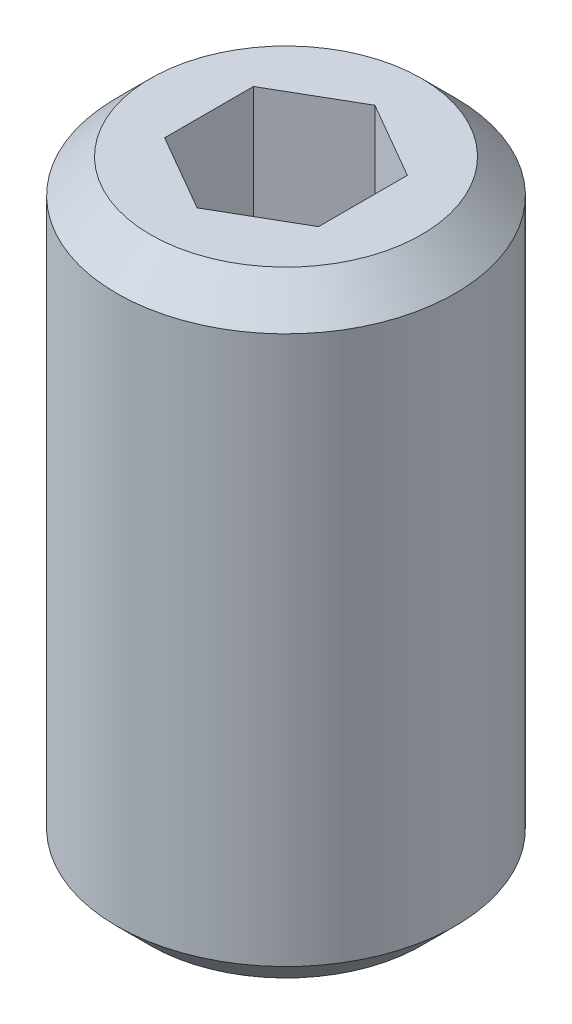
ISO-10303-21;
HEADER;
FILE_DESCRIPTION(('STEP AP214'),'2;1');
FILE_NAME('part.step','',(''),(''),'','','');
FILE_SCHEMA(('AUTOMOTIVE_DESIGN { 1 0 10303 214 1 1 1 1 }'));
ENDSEC;
DATA;
#1=APPLICATION_CONTEXT('core data for automotive mechanical design processes');
#2=APPLICATION_PROTOCOL_DEFINITION('international standard','automotive_design',2000,#1);
#3=PRODUCT_CONTEXT('',#1,'mechanical');
#4=PRODUCT('Part','Part','',(#3));
#5=PRODUCT_RELATED_PRODUCT_CATEGORY('part','',(#4));
#6=PRODUCT_DEFINITION_FORMATION('','',#4);
#7=PRODUCT_DEFINITION_CONTEXT('part definition',#1,'design');
#8=PRODUCT_DEFINITION('design','',#6,#7);
#9=PRODUCT_DEFINITION_SHAPE('','',#8);
#10=(LENGTH_UNIT() NAMED_UNIT(*) SI_UNIT(.MILLI.,.METRE.));
#11=(NAMED_UNIT(*) PLANE_ANGLE_UNIT() SI_UNIT($,.RADIAN.));
#12=(NAMED_UNIT(*) SI_UNIT($,.STERADIAN.) SOLID_ANGLE_UNIT());
#13=UNCERTAINTY_MEASURE_WITH_UNIT(LENGTH_MEASURE(1.E-05),#10,'distance_accuracy_value','');
#14=(GEOMETRIC_REPRESENTATION_CONTEXT(3) GLOBAL_UNCERTAINTY_ASSIGNED_CONTEXT((#13)) GLOBAL_UNIT_ASSIGNED_CONTEXT((#10,
#11,#12)) REPRESENTATION_CONTEXT('',''));
#15=CARTESIAN_POINT('',(0.,0.,0.));
#16=DIRECTION('',(0.,0.,1.));
#17=DIRECTION('',(1.,0.,0.));
#18=AXIS2_PLACEMENT_3D('',#15,#16,#17);
#19=CARTESIAN_POINT('',(0.,-6.,0.));
#20=DIRECTION('',(0.,1.,0.));
#21=DIRECTION('',(0.,0.,1.));
#22=AXIS2_PLACEMENT_3D('',#19,#20,#21);
#23=PLANE('',#22);
#24=CARTESIAN_POINT('',(0.,-6.,0.));
#25=DIRECTION('',(0.,1.,0.));
#26=DIRECTION('',(0.,0.,1.));
#27=AXIS2_PLACEMENT_3D('',#24,#25,#26);
#28=CIRCLE('',#27,1.32);
#29=CARTESIAN_POINT('',(0.,-6.,1.32));
#30=VERTEX_POINT('',#29);
#31=EDGE_CURVE('E473',#30,#30,#28,.F.);
#32=ORIENTED_EDGE('',*,*,#31,.T.);
#33=EDGE_LOOP('',(#32));
#34=FACE_BOUND('',#33,.T.);
#35=ADVANCED_FACE('F362',(#34),#23,.F.);
#36=CARTESIAN_POINT('',(0.,0.,0.));
#37=DIRECTION('',(0.,1.,0.));
#38=DIRECTION('',(0.,0.,1.));
#39=AXIS2_PLACEMENT_3D('',#36,#37,#38);
#40=CYLINDRICAL_SURFACE('',#39,1.65);
#41=CARTESIAN_POINT('',(0.,-0.330000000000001,0.));
#42=DIRECTION('',(0.,-1.,0.));
#43=DIRECTION('',(0.,0.,-1.));
#44=AXIS2_PLACEMENT_3D('',#41,#42,#43);
#45=CIRCLE('',#44,1.65);
#46=CARTESIAN_POINT('',(0.,-0.330000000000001,-1.65));
#47=VERTEX_POINT('',#46);
#48=EDGE_CURVE('E11',#47,#47,#45,.T.);
#49=ORIENTED_EDGE('',*,*,#48,.T.);
#50=EDGE_LOOP('',(#49));
#51=FACE_BOUND('',#50,.T.);
#52=CARTESIAN_POINT('',(0.,-5.67,0.));
#53=DIRECTION('',(0.,1.,0.));
#54=DIRECTION('',(0.,0.,1.));
#55=AXIS2_PLACEMENT_3D('',#52,#53,#54);
#56=CIRCLE('',#55,1.65);
#57=CARTESIAN_POINT('',(0.,-5.67,1.65));
#58=VERTEX_POINT('',#57);
#59=EDGE_CURVE('E464',#58,#58,#56,.T.);
#60=ORIENTED_EDGE('',*,*,#59,.T.);
#61=EDGE_LOOP('',(#60));
#62=FACE_BOUND('',#61,.T.);
#63=ADVANCED_FACE('F496',(#51,#62),#40,.T.);
#64=CARTESIAN_POINT('',(0.,0.,0.));
#65=DIRECTION('',(0.,-1.,0.));
#66=DIRECTION('',(0.,0.,-1.));
#67=AXIS2_PLACEMENT_3D('',#64,#65,#66);
#68=PLANE('',#67);
#69=DIRECTION('',(0.866025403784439,0.,-0.5));
#70=VECTOR('',#69,1.);
#71=CARTESIAN_POINT('',(0.,0.,0.866025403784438));
#72=LINE('',#71,#70);
#73=CARTESIAN_POINT('',(0.,0.,0.866025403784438));
#74=VERTEX_POINT('',#73);
#75=CARTESIAN_POINT('',(0.749999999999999,0.,0.433012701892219));
#76=VERTEX_POINT('',#75);
#77=EDGE_CURVE('E430',#74,#76,#72,.T.);
#78=ORIENTED_EDGE('',*,*,#77,.F.);
#79=DIRECTION('',(0.866025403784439,0.,0.5));
#80=VECTOR('',#79,1.);
#81=CARTESIAN_POINT('',(-0.749999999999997,0.,0.43301270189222));
#82=LINE('',#81,#80);
#83=CARTESIAN_POINT('',(-0.749999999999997,0.,0.43301270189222));
#84=VERTEX_POINT('',#83);
#85=EDGE_CURVE('E376',#84,#74,#82,.T.);
#86=ORIENTED_EDGE('',*,*,#85,.F.);
#87=DIRECTION('',(0.,0.,1.));
#88=VECTOR('',#87,1.);
#89=CARTESIAN_POINT('',(-0.749999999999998,0.,-0.433012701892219));
#90=LINE('',#89,#88);
#91=CARTESIAN_POINT('',(-0.749999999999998,0.,-0.433012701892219));
#92=VERTEX_POINT('',#91);
#93=EDGE_CURVE('E446',#92,#84,#90,.T.);
#94=ORIENTED_EDGE('',*,*,#93,.F.);
#95=DIRECTION('',(-0.866025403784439,0.,0.5));
#96=VECTOR('',#95,1.);
#97=CARTESIAN_POINT('',(0.,0.,-0.866025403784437));
#98=LINE('',#97,#96);
#99=CARTESIAN_POINT('',(0.,0.,-0.866025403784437));
#100=VERTEX_POINT('',#99);
#101=EDGE_CURVE('E440',#100,#92,#98,.T.);
#102=ORIENTED_EDGE('',*,*,#101,.F.);
#103=DIRECTION('',(-0.866025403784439,0.,-0.499999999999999));
#104=VECTOR('',#103,1.);
#105=CARTESIAN_POINT('',(0.749999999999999,0.,-0.433012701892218));
#106=LINE('',#105,#104);
#107=CARTESIAN_POINT('',(0.749999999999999,0.,-0.433012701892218));
#108=VERTEX_POINT('',#107);
#109=EDGE_CURVE('E438',#108,#100,#106,.T.);
#110=ORIENTED_EDGE('',*,*,#109,.F.);
#111=DIRECTION('',(0.,0.,-1.));
#112=VECTOR('',#111,1.);
#113=CARTESIAN_POINT('',(0.749999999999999,0.,0.433012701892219));
#114=LINE('',#113,#112);
#115=EDGE_CURVE('E419',#76,#108,#114,.T.);
#116=ORIENTED_EDGE('',*,*,#115,.F.);
#117=EDGE_LOOP('',(#78,#86,#94,#102,#110,#116));
#118=FACE_BOUND('',#117,.T.);
#119=CARTESIAN_POINT('',(0.,0.,0.));
#120=DIRECTION('',(0.,-1.,0.));
#121=DIRECTION('',(0.,0.,-1.));
#122=AXIS2_PLACEMENT_3D('',#119,#120,#121);
#123=CIRCLE('',#122,1.32);
#124=CARTESIAN_POINT('',(0.,0.,-1.32));
#125=VERTEX_POINT('',#124);
#126=EDGE_CURVE('E369',#125,#125,#123,.F.);
#127=ORIENTED_EDGE('',*,*,#126,.T.);
#128=EDGE_LOOP('',(#127));
#129=FACE_BOUND('',#128,.T.);
#130=ADVANCED_FACE('F434',(#118,#129),#68,.F.);
#131=CARTESIAN_POINT('',(0.,-5.67,0.));
#132=DIRECTION('',(0.,1.,0.));
#133=DIRECTION('',(0.,0.,1.));
#134=AXIS2_PLACEMENT_3D('',#131,#132,#133);
#135=CONICAL_SURFACE('',#134,1.65,0.785398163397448);
#136=ORIENTED_EDGE('',*,*,#31,.F.);
#137=EDGE_LOOP('',(#136));
#138=FACE_BOUND('',#137,.T.);
#139=ORIENTED_EDGE('',*,*,#59,.F.);
#140=EDGE_LOOP('',(#139));
#141=FACE_BOUND('',#140,.T.);
#142=ADVANCED_FACE('F481',(#138,#141),#135,.T.);
#143=CARTESIAN_POINT('',(0.,0.,0.));
#144=DIRECTION('',(0.,-1.,0.));
#145=DIRECTION('',(0.,0.,-1.));
#146=AXIS2_PLACEMENT_3D('',#143,#144,#145);
#147=CONICAL_SURFACE('',#146,1.32,0.785398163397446);
#148=CARTESIAN_POINT('',(0.,-0.330000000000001,-1.65));
#149=CARTESIAN_POINT('',(0.,-0.326562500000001,-1.6465625));
#150=CARTESIAN_POINT('',(0.,-0.323125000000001,-1.643125));
#151=CARTESIAN_POINT('',(0.,-0.316250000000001,-1.63625));
#152=CARTESIAN_POINT('',(0.,-0.312812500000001,-1.6328125));
#153=CARTESIAN_POINT('',(0.,-0.305937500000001,-1.6259375));
#154=CARTESIAN_POINT('',(0.,-0.302500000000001,-1.6225));
#155=CARTESIAN_POINT('',(0.,-0.295625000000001,-1.615625));
#156=CARTESIAN_POINT('',(0.,-0.292187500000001,-1.6121875));
#157=CARTESIAN_POINT('',(0.,-0.285312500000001,-1.6053125));
#158=CARTESIAN_POINT('',(0.,-0.281875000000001,-1.601875));
#159=CARTESIAN_POINT('',(0.,-0.275000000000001,-1.595));
#160=CARTESIAN_POINT('',(0.,-0.271562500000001,-1.5915625));
#161=CARTESIAN_POINT('',(0.,-0.264687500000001,-1.5846875));
#162=CARTESIAN_POINT('',(0.,-0.261250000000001,-1.58125));
#163=CARTESIAN_POINT('',(0.,-0.254375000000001,-1.574375));
#164=CARTESIAN_POINT('',(0.,-0.250937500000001,-1.5709375));
#165=CARTESIAN_POINT('',(0.,-0.244062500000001,-1.5640625));
#166=CARTESIAN_POINT('',(0.,-0.240625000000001,-1.560625));
#167=CARTESIAN_POINT('',(0.,-0.233750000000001,-1.55375));
#168=CARTESIAN_POINT('',(0.,-0.230312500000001,-1.5503125));
#169=CARTESIAN_POINT('',(0.,-0.223437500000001,-1.5434375));
#170=CARTESIAN_POINT('',(0.,-0.220000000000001,-1.54));
#171=CARTESIAN_POINT('',(0.,-0.213125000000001,-1.533125));
#172=CARTESIAN_POINT('',(0.,-0.209687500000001,-1.5296875));
#173=CARTESIAN_POINT('',(0.,-0.202812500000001,-1.5228125));
#174=CARTESIAN_POINT('',(0.,-0.199375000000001,-1.519375));
#175=CARTESIAN_POINT('',(0.,-0.192500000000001,-1.5125));
#176=CARTESIAN_POINT('',(0.,-0.189062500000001,-1.5090625));
#177=CARTESIAN_POINT('',(0.,-0.182187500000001,-1.5021875));
#178=CARTESIAN_POINT('',(0.,-0.178750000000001,-1.49875));
#179=CARTESIAN_POINT('',(0.,-0.171875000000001,-1.491875));
#180=CARTESIAN_POINT('',(0.,-0.168437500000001,-1.4884375));
#181=CARTESIAN_POINT('',(0.,-0.161562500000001,-1.4815625));
#182=CARTESIAN_POINT('',(0.,-0.158125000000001,-1.478125));
#183=CARTESIAN_POINT('',(0.,-0.151250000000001,-1.47125));
#184=CARTESIAN_POINT('',(0.,-0.147812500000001,-1.4678125));
#185=CARTESIAN_POINT('',(0.,-0.140937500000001,-1.4609375));
#186=CARTESIAN_POINT('',(0.,-0.137500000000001,-1.4575));
#187=CARTESIAN_POINT('',(0.,-0.130625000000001,-1.450625));
#188=CARTESIAN_POINT('',(0.,-0.127187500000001,-1.4471875));
#189=CARTESIAN_POINT('',(0.,-0.120312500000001,-1.4403125));
#190=CARTESIAN_POINT('',(0.,-0.116875,-1.436875));
#191=CARTESIAN_POINT('',(0.,-0.11,-1.43));
#192=CARTESIAN_POINT('',(0.,-0.1065625,-1.4265625));
#193=CARTESIAN_POINT('',(0.,-0.0996875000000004,-1.4196875));
#194=CARTESIAN_POINT('',(0.,-0.0962500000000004,-1.41625));
#195=CARTESIAN_POINT('',(0.,-0.0893750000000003,-1.409375));
#196=CARTESIAN_POINT('',(0.,-0.0859375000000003,-1.4059375));
#197=CARTESIAN_POINT('',(0.,-0.0790625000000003,-1.3990625));
#198=CARTESIAN_POINT('',(0.,-0.0756250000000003,-1.395625));
#199=CARTESIAN_POINT('',(0.,-0.0687500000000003,-1.38875));
#200=CARTESIAN_POINT('',(0.,-0.0653125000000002,-1.3853125));
#201=CARTESIAN_POINT('',(0.,-0.0584375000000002,-1.3784375));
#202=CARTESIAN_POINT('',(0.,-0.0550000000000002,-1.375));
#203=CARTESIAN_POINT('',(0.,-0.0481250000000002,-1.368125));
#204=CARTESIAN_POINT('',(0.,-0.0446875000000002,-1.3646875));
#205=CARTESIAN_POINT('',(0.,-0.0378125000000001,-1.3578125));
#206=CARTESIAN_POINT('',(0.,-0.0343750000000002,-1.354375));
#207=CARTESIAN_POINT('',(0.,-0.0275000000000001,-1.3475));
#208=CARTESIAN_POINT('',(0.,-0.0240625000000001,-1.3440625));
#209=CARTESIAN_POINT('',(0.,-0.0171875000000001,-1.3371875));
#210=CARTESIAN_POINT('',(0.,-0.0137500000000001,-1.33375));
#211=CARTESIAN_POINT('',(0.,-0.00687500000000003,-1.326875));
#212=CARTESIAN_POINT('',(0.,-0.00343750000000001,-1.3234375));
#213=CARTESIAN_POINT('',(0.,0.,-1.32));
#214=B_SPLINE_CURVE_WITH_KNOTS('',3,(#148,#149,#150,#151,#152,#153,#154,#155,#156,#157,#158,
#159,#160,#161,#162,#163,#164,#165,#166,#167,#168,#169,#170,#171,#172,#173,#174,#175,#176,#177,
#178,#179,#180,#181,#182,#183,#184,#185,#186,#187,#188,#189,#190,#191,#192,#193,#194,#195,#196,
#197,#198,#199,#200,#201,#202,#203,#204,#205,#206,#207,#208,#209,#210,#211,#212,#213),
.UNSPECIFIED.,.F.,.F.,(4,2,2,2,2,2,2,2,2,2,2,2,2,2,2,2,2,2,2,2,2,2,2,2,2,2,2,2,2,2,2,2,4),(0.,
0.0145840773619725,0.0291681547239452,0.0437522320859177,0.0583363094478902,0.0729203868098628,
0.0875044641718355,0.102088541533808,0.11667261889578,0.131256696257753,0.145840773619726,
0.160424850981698,0.175008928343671,0.189593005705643,0.204177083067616,0.218761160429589,
0.233345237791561,0.247929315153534,0.262513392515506,0.277097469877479,0.291681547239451,
0.306265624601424,0.320849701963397,0.335433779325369,0.350017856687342,0.364601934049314,
0.379186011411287,0.39377008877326,0.408354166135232,0.422938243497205,0.437522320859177,
0.45210639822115,0.466690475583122),.UNSPECIFIED.);
#215=EDGE_CURVE('BSEAM478',#47,#125,#214,.T.);
#216=ORIENTED_EDGE('',*,*,#48,.F.);
#217=ORIENTED_EDGE('',*,*,#126,.F.);
#218=ORIENTED_EDGE('',*,*,#215,.T.);
#219=ORIENTED_EDGE('',*,*,#215,.F.);
#220=EDGE_LOOP('',(#216,#218,#217,#219));
#221=FACE_BOUND('',#220,.T.);
#222=ADVANCED_FACE('F478',(#221),#147,.T.);
#223=CARTESIAN_POINT('',(-0.749999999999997,-2.5,0.43301270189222));
#224=DIRECTION('',(-0.5,0.,0.866025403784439));
#225=DIRECTION('',(0.866025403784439,0.,0.5));
#226=AXIS2_PLACEMENT_3D('',#223,#224,#225);
#227=PLANE('',#226);
#228=ORIENTED_EDGE('',*,*,#85,.T.);
#229=DIRECTION('',(0.,1.,0.));
#230=VECTOR('',#229,1.);
#231=CARTESIAN_POINT('',(0.,-2.5,0.866025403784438));
#232=LINE('',#231,#230);
#233=CARTESIAN_POINT('',(0.,-2.5,0.866025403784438));
#234=VERTEX_POINT('',#233);
#235=EDGE_CURVE('E427',#234,#74,#232,.T.);
#236=ORIENTED_EDGE('',*,*,#235,.F.);
#237=DIRECTION('',(0.866025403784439,0.,0.5));
#238=VECTOR('',#237,1.);
#239=CARTESIAN_POINT('',(-0.749999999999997,-2.5,0.43301270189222));
#240=LINE('',#239,#238);
#241=CARTESIAN_POINT('',(-0.749999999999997,-2.5,0.43301270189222));
#242=VERTEX_POINT('',#241);
#243=EDGE_CURVE('E448',#242,#234,#240,.T.);
#244=ORIENTED_EDGE('',*,*,#243,.F.);
#245=DIRECTION('',(0.,1.,0.));
#246=VECTOR('',#245,1.);
#247=CARTESIAN_POINT('',(-0.749999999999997,-2.5,0.43301270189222));
#248=LINE('',#247,#246);
#249=EDGE_CURVE('E383',#242,#84,#248,.T.);
#250=ORIENTED_EDGE('',*,*,#249,.T.);
#251=EDGE_LOOP('',(#228,#236,#244,#250));
#252=FACE_BOUND('',#251,.T.);
#253=ADVANCED_FACE('F480',(#252),#227,.F.);
#254=CARTESIAN_POINT('',(-0.749999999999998,-2.5,-0.433012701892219));
#255=DIRECTION('',(-1.,0.,0.));
#256=DIRECTION('',(0.,0.,1.));
#257=AXIS2_PLACEMENT_3D('',#254,#255,#256);
#258=PLANE('',#257);
#259=ORIENTED_EDGE('',*,*,#93,.T.);
#260=ORIENTED_EDGE('',*,*,#249,.F.);
#261=DIRECTION('',(0.,0.,1.));
#262=VECTOR('',#261,1.);
#263=CARTESIAN_POINT('',(-0.749999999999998,-2.5,-0.433012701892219));
#264=LINE('',#263,#262);
#265=CARTESIAN_POINT('',(-0.749999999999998,-2.5,-0.433012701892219));
#266=VERTEX_POINT('',#265);
#267=EDGE_CURVE('E460',#266,#242,#264,.T.);
#268=ORIENTED_EDGE('',*,*,#267,.F.);
#269=DIRECTION('',(0.,1.,0.));
#270=VECTOR('',#269,1.);
#271=CARTESIAN_POINT('',(-0.749999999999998,-2.5,-0.433012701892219));
#272=LINE('',#271,#270);
#273=EDGE_CURVE('E465',#266,#92,#272,.T.);
#274=ORIENTED_EDGE('',*,*,#273,.T.);
#275=EDGE_LOOP('',(#259,#260,#268,#274));
#276=FACE_BOUND('',#275,.T.);
#277=ADVANCED_FACE('F489',(#276),#258,.F.);
#278=CARTESIAN_POINT('',(0.,-2.5,-0.866025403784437));
#279=DIRECTION('',(-0.5,0.,-0.866025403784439));
#280=DIRECTION('',(-0.866025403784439,0.,0.5));
#281=AXIS2_PLACEMENT_3D('',#278,#279,#280);
#282=PLANE('',#281);
#283=ORIENTED_EDGE('',*,*,#101,.T.);
#284=ORIENTED_EDGE('',*,*,#273,.F.);
#285=DIRECTION('',(-0.866025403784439,0.,0.5));
#286=VECTOR('',#285,1.);
#287=CARTESIAN_POINT('',(0.,-2.5,-0.866025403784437));
#288=LINE('',#287,#286);
#289=CARTESIAN_POINT('',(0.,-2.5,-0.866025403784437));
#290=VERTEX_POINT('',#289);
#291=EDGE_CURVE('E457',#290,#266,#288,.T.);
#292=ORIENTED_EDGE('',*,*,#291,.F.);
#293=DIRECTION('',(0.,1.,0.));
#294=VECTOR('',#293,1.);
#295=CARTESIAN_POINT('',(0.,-2.5,-0.866025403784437));
#296=LINE('',#295,#294);
#297=EDGE_CURVE('E467',#290,#100,#296,.T.);
#298=ORIENTED_EDGE('',*,*,#297,.T.);
#299=EDGE_LOOP('',(#283,#284,#292,#298));
#300=FACE_BOUND('',#299,.T.);
#301=ADVANCED_FACE('F521',(#300),#282,.F.);
#302=CARTESIAN_POINT('',(0.749999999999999,-2.5,-0.433012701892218));
#303=DIRECTION('',(0.499999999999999,0.,-0.866025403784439));
#304=DIRECTION('',(-0.866025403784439,0.,-0.499999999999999));
#305=AXIS2_PLACEMENT_3D('',#302,#303,#304);
#306=PLANE('',#305);
#307=ORIENTED_EDGE('',*,*,#109,.T.);
#308=ORIENTED_EDGE('',*,*,#297,.F.);
#309=DIRECTION('',(-0.866025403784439,0.,-0.499999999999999));
#310=VECTOR('',#309,1.);
#311=CARTESIAN_POINT('',(0.749999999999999,-2.5,-0.433012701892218));
#312=LINE('',#311,#310);
#313=CARTESIAN_POINT('',(0.749999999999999,-2.5,-0.433012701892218));
#314=VERTEX_POINT('',#313);
#315=EDGE_CURVE('E454',#314,#290,#312,.T.);
#316=ORIENTED_EDGE('',*,*,#315,.F.);
#317=DIRECTION('',(0.,1.,0.));
#318=VECTOR('',#317,1.);
#319=CARTESIAN_POINT('',(0.749999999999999,-2.5,-0.433012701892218));
#320=LINE('',#319,#318);
#321=EDGE_CURVE('E426',#314,#108,#320,.T.);
#322=ORIENTED_EDGE('',*,*,#321,.T.);
#323=EDGE_LOOP('',(#307,#308,#316,#322));
#324=FACE_BOUND('',#323,.T.);
#325=ADVANCED_FACE('F528',(#324),#306,.F.);
#326=CARTESIAN_POINT('',(0.749999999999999,-2.5,0.433012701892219));
#327=DIRECTION('',(1.,0.,0.));
#328=DIRECTION('',(0.,0.,-1.));
#329=AXIS2_PLACEMENT_3D('',#326,#327,#328);
#330=PLANE('',#329);
#331=ORIENTED_EDGE('',*,*,#115,.T.);
#332=ORIENTED_EDGE('',*,*,#321,.F.);
#333=DIRECTION('',(0.,0.,-1.));
#334=VECTOR('',#333,1.);
#335=CARTESIAN_POINT('',(0.749999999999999,-2.5,0.433012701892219));
#336=LINE('',#335,#334);
#337=CARTESIAN_POINT('',(0.749999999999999,-2.5,0.433012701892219));
#338=VERTEX_POINT('',#337);
#339=EDGE_CURVE('E422',#338,#314,#336,.T.);
#340=ORIENTED_EDGE('',*,*,#339,.F.);
#341=DIRECTION('',(0.,1.,0.));
#342=VECTOR('',#341,1.);
#343=CARTESIAN_POINT('',(0.749999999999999,-2.5,0.433012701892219));
#344=LINE('',#343,#342);
#345=EDGE_CURVE('E415',#338,#76,#344,.T.);
#346=ORIENTED_EDGE('',*,*,#345,.T.);
#347=EDGE_LOOP('',(#331,#332,#340,#346));
#348=FACE_BOUND('',#347,.T.);
#349=ADVANCED_FACE('F417',(#348),#330,.F.);
#350=CARTESIAN_POINT('',(0.,-2.5,0.866025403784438));
#351=DIRECTION('',(0.5,0.,0.866025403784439));
#352=DIRECTION('',(0.866025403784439,0.,-0.5));
#353=AXIS2_PLACEMENT_3D('',#350,#351,#352);
#354=PLANE('',#353);
#355=ORIENTED_EDGE('',*,*,#77,.T.);
#356=ORIENTED_EDGE('',*,*,#345,.F.);
#357=DIRECTION('',(0.866025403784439,0.,-0.5));
#358=VECTOR('',#357,1.);
#359=CARTESIAN_POINT('',(0.,-2.5,0.866025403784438));
#360=LINE('',#359,#358);
#361=EDGE_CURVE('E451',#234,#338,#360,.T.);
#362=ORIENTED_EDGE('',*,*,#361,.F.);
#363=ORIENTED_EDGE('',*,*,#235,.T.);
#364=EDGE_LOOP('',(#355,#356,#362,#363));
#365=FACE_BOUND('',#364,.T.);
#366=ADVANCED_FACE('F431',(#365),#354,.F.);
#367=CARTESIAN_POINT('',(0.749999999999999,-2.5,1.29903810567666));
#368=DIRECTION('',(0.,1.,0.));
#369=DIRECTION('',(0.,0.,1.));
#370=AXIS2_PLACEMENT_3D('',#367,#368,#369);
#371=PLANE('',#370);
#372=ORIENTED_EDGE('',*,*,#243,.T.);
#373=ORIENTED_EDGE('',*,*,#361,.T.);
#374=ORIENTED_EDGE('',*,*,#339,.T.);
#375=ORIENTED_EDGE('',*,*,#315,.T.);
#376=ORIENTED_EDGE('',*,*,#291,.T.);
#377=ORIENTED_EDGE('',*,*,#267,.T.);
#378=EDGE_LOOP('',(#372,#373,#374,#375,#376,#377));
#379=FACE_BOUND('',#378,.T.);
#380=ADVANCED_FACE('F549',(#379),#371,.T.);
#381=CLOSED_SHELL('',(#35,#63,#130,#142,#222,#253,#277,#301,#325,#349,#366,#380));
#382=MANIFOLD_SOLID_BREP('B2',#381);
#383=ADVANCED_BREP_SHAPE_REPRESENTATION('',(#18,#382),#14);
#384=SHAPE_DEFINITION_REPRESENTATION(#9,#383);
ENDSEC;
END-ISO-10303-21;
